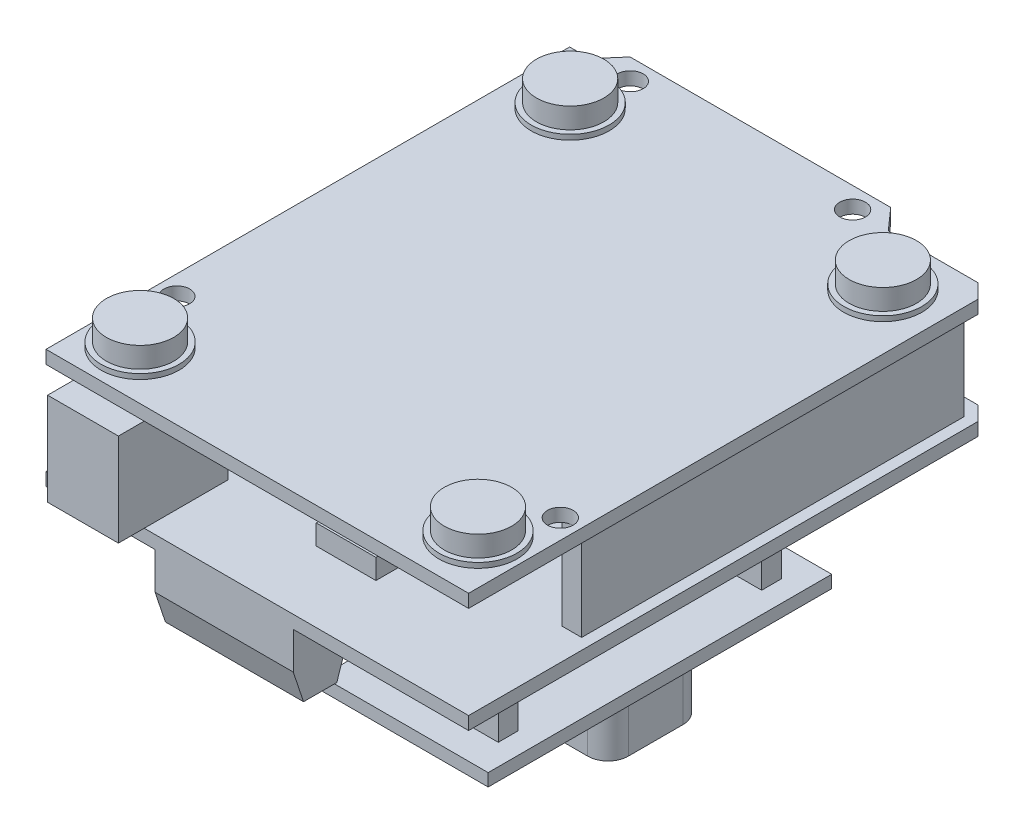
from build123d import *
from OCP.BRepFilletAPI import BRepFilletAPI_MakeChamfer

# Parameters (mm, degrees)
SKETCH1_R                = 1.61925
BOSS_EXTRUDE1_DEPTH      = 1.651
SKETCH2_R                = 4.9149
BOSS_EXTRUDE2_DEPTH      = 0.6477
SKETCH4_R                = 4.2418
BOSS_EXTRUDE3_DEPTH      = 3.2512
SKETCH6_W                = 2.4638
SKETCH6_H                = 48.1457
SKETCH6_H_2              = 38.8493
BOSS_EXTRUDE4_DEPTH      = 11.684
BOSS_EXTRUDE5_DEPTH      = 1.6383
BOSS_EXTRUDE6_DEPTH      = 0.2667
BOSS_EXTRUDE6_DEPTH_BACK = 5.08
SKETCH8_W                = 7.5184
SKETCH8_H                = 2.5273
BOSS_EXTRUDE7_DEPTH      = 3.2512
BOSS_EXTRUDE7_DEPTH_BACK = 10.541
SKETCH9_W                = 8.9154
SKETCH9_H                = 11.684
SKETCH10_W               = 17.399
SKETCH10_H               = 6.7818
SKETCH10_W_2             = 6.7818
SKETCH10_H_2             = 7.0485
BOSS_EXTRUDE8_DEPTH      = 8.5471
CHAMFER1_SIZE            = 3.8862
CHAMFER1_SIZE2           = 1.2954
SKETCH12_W               = 15.367
SKETCH12_H               = 9.0043
BOSS_EXTRUDE9_DEPTH      = 4.6101
SKETCH13_W               = 7.5184
SKETCH13_H               = 5.3467
BOSS_EXTRUDE10_DEPTH     = 2.667
SKETCH14_W               = 2.54
SKETCH14_H               = 5.1816
BOSS_EXTRUDE11_DEPTH     = 16.1544
SKETCH15_W               = 15.113
SKETCH15_H               = 2.4892
BOSS_EXTRUDE12_DEPTH     = 13.208
SKETCH16_W               = 21.0058
SKETCH16_H               = 43.2689
BOSS_EXTRUDE13_DEPTH     = 1.5748
SKETCH17_R               = 3.2258
BOSS_EXTRUDE14_DEPTH     = 5.9944
SKETCH18_R               = 3.2258
BOSS_EXTRUDE15_DEPTH     = 7.9629


with BuildPart() as part:
    # Sketch1 → Boss-Extrude1 (new body)
    with BuildSketch(Plane(origin=(0, 0, 0), x_dir=(1, 0, 0), z_dir=(0, 1, 0))):
        Polygon((0, 65.9511), (2.54, 65.9511), (4.891832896, 68.6689), (37.721332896, 68.6689), (40.130988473, 65.9511), (51.429648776, 65.9511), (53.2257, 64.155048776), (53.2257, 0), (0, 0), align=None)
        with Locations(Location((7.56285, 66.03365, 0), (0, 0, 270))):
            Circle(SKETCH1_R, mode=Mode.SUBTRACT)
        with Locations(Location((35.55365, 66.03365, 0), (0, 0, 270))):
            Circle(SKETCH1_R, mode=Mode.SUBTRACT)
        with Locations(Location((2.4638, 14.01445, 0), (0, 0, 270))):
            Circle(SKETCH1_R, mode=Mode.SUBTRACT)
        with Locations(Location((50.7619, 14.01445, 0), (0, 0, 270))):
            Circle(SKETCH1_R, mode=Mode.SUBTRACT)
    extrude(amount=-BOSS_EXTRUDE1_DEPTH)

    # Sketch2 → Boss-Extrude2 (add)
    with BuildSketch(Plane(origin=(0, 0, 0), x_dir=(1, 0, 0), z_dir=(0, 1, 0))):
        with Locations(Location((46.2153, 59.182, 0), (0, 0, 90))):
            Circle(SKETCH2_R)
        with Locations(Location((6.731, 59.2836, 0), (0, 0, 90))):
            Circle(SKETCH2_R)
        with Locations(Location((5.7531, 6.096, 0), (0, 0, 90))):
            Circle(SKETCH2_R)
        with Locations(Location((47.625, 6.7818, 0), (0, 0, 90))):
            Circle(SKETCH2_R)
    extrude(amount=BOSS_EXTRUDE2_DEPTH)

    # Sketch4 → Boss-Extrude3 (add)
    with BuildSketch(Plane(origin=(0, 0, 0), x_dir=(1, 0, 0), z_dir=(0, 1, 0))):
        with Locations(Location((47.625, 6.7818, 0), (0, 0, 270))):
            Circle(SKETCH4_R)
        with Locations(Location((5.7531, 6.096, 0), (0, 0, 270))):
            Circle(SKETCH4_R)
        with Locations(Location((46.2153, 59.182, 0), (0, 0, 270))):
            Circle(SKETCH4_R)
        with Locations(Location((6.731, 59.2836, 0), (0, 0, 270))):
            Circle(SKETCH4_R)
    extrude(amount=BOSS_EXTRUDE3_DEPTH)

    # Sketch6 → Boss-Extrude4 (add)
    with BuildSketch(Plane.XZ.offset(1.651)):
        with Locations((50.5968, -39.70655)):
            Rectangle(SKETCH6_W, SKETCH6_H)
        with Locations((2.6289, -44.35475)):
            Rectangle(SKETCH6_W, SKETCH6_H_2)
    extrude(amount=BOSS_EXTRUDE4_DEPTH)

    # Sketch7 → Boss-Extrude5 (add)
    with BuildSketch(Plane.XZ.offset(13.335)):
        Polygon((0, 0), (53.2257, 0), (53.2257, -64.155048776), (51.429648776, -65.9511), (40.130988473, -65.9511), (37.721332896, -68.6689), (4.891832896, -68.6689), (2.54, -65.9511), (0, -65.9511), align=None)
    extrude(amount=BOSS_EXTRUDE5_DEPTH)

    # Sketch8 → Boss-Extrude6 (add, two sides: drawn at the far end of the back side and taken through both)
    with BuildSketch(Plane.XY.offset(-BOSS_EXTRUDE6_DEPTH_BACK)):
        with Locations((38.0619, -2.91465)):
            Rectangle(SKETCH8_W, SKETCH8_H)
    extrude(amount=BOSS_EXTRUDE6_DEPTH + BOSS_EXTRUDE6_DEPTH_BACK)

    # Sketch9 → Boss-Extrude7 (add, two sides: drawn at the far end of the back side and taken through both)
    with BuildSketch(Plane.XY.offset(-BOSS_EXTRUDE7_DEPTH_BACK)):
        with Locations((7.9121, -7.493)):
            Rectangle(SKETCH9_W, SKETCH9_H)
    extrude(amount=BOSS_EXTRUDE7_DEPTH + BOSS_EXTRUDE7_DEPTH_BACK)

    # Sketch10 → Boss-Extrude8 (add)
    with BuildSketch(Plane.XZ.offset(14.9733)):
        with Locations((22.4409, -3.3909)):
            Rectangle(SKETCH10_W, SKETCH10_H)
        with Locations((3.3909, -20.35175)):
            Rectangle(SKETCH10_W_2, SKETCH10_H_2)
        with Locations((14.1097, -65.278)):
            Rectangle(SKETCH10_W, SKETCH10_H)
    extrude(amount=BOSS_EXTRUDE8_DEPTH)

    # Chamfer1: one chamfer whose edges measure the first distance from different faces: ONE call of the kernel's chamfer builder (chamfer() names one face for all edges)
    chamfer1_edges_1 = [part.edges().sort_by_distance(p)[0] for p in [
        (22.4409, -23.5204, -6.7818),
    ]]
    chamfer1_side_1 = [part.faces().sort_by_distance(p)[0] for p in [
        (22.4409, -19.24685, -6.7818),
    ]]
    chamfer1_edges_2 = [part.edges().sort_by_distance(p)[0] for p in [
        (22.4409, -23.5204, 0),
    ]]
    chamfer1_side_2 = [part.faces().sort_by_distance(p)[0] for p in [
        (23.982978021, -17.364435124, 0),
    ]]
    chamfer1_edges_3 = [part.edges().sort_by_distance(p)[0] for p in [
        (0, -23.5204, -20.35175),
    ]]
    chamfer1_side_3 = [part.faces().sort_by_distance(p)[0] for p in [
        (0, -14.15415, -65.283770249),
    ]]
    chamfer1_edges_4 = [part.edges().sort_by_distance(p)[0] for p in [
        (6.7818, -23.5204, -20.35175),
    ]]
    chamfer1_side_4 = [part.faces().sort_by_distance(p)[0] for p in [
        (6.7818, -19.24685, -20.35175),
    ]]
    chamfer1_edges_5 = [part.edges().sort_by_distance(p)[0] for p in [
        (14.1097, -23.5204, -68.6689),
    ]]
    chamfer1_side_5 = [part.faces().sort_by_distance(p)[0] for p in [
        (16.021254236, -17.894184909, -68.6689),
    ]]
    chamfer1_edges_6 = [part.edges().sort_by_distance(p)[0] for p in [
        (14.1097, -23.5204, -61.8871),
    ]]
    chamfer1_side_6 = [part.faces().sort_by_distance(p)[0] for p in [
        (14.1097, -19.24685, -61.8871),
    ]]
    chamfer1 = BRepFilletAPI_MakeChamfer(part.part.solid().wrapped)
    for e in chamfer1_edges_1:
        chamfer1.Add(CHAMFER1_SIZE, CHAMFER1_SIZE2, e.wrapped, chamfer1_side_1[0].wrapped)  # the first distance lies on this face
    for e in chamfer1_edges_2:
        chamfer1.Add(CHAMFER1_SIZE, CHAMFER1_SIZE2, e.wrapped, chamfer1_side_2[0].wrapped)  # the first distance lies on this face
    for e in chamfer1_edges_3:
        chamfer1.Add(CHAMFER1_SIZE, CHAMFER1_SIZE2, e.wrapped, chamfer1_side_3[0].wrapped)  # the first distance lies on this face
    for e in chamfer1_edges_4:
        chamfer1.Add(CHAMFER1_SIZE, CHAMFER1_SIZE2, e.wrapped, chamfer1_side_4[0].wrapped)  # the first distance lies on this face
    for e in chamfer1_edges_5:
        chamfer1.Add(CHAMFER1_SIZE, CHAMFER1_SIZE2, e.wrapped, chamfer1_side_5[0].wrapped)  # the first distance lies on this face
    for e in chamfer1_edges_6:
        chamfer1.Add(CHAMFER1_SIZE, CHAMFER1_SIZE2, e.wrapped, chamfer1_side_6[0].wrapped)  # the first distance lies on this face
    add(Compound.cast(chamfer1.Shape()), mode=Mode.REPLACE)

    # Sketch12 → Boss-Extrude9 (add)
    with BuildSketch(Plane.XZ.offset(14.9733)):
        with Locations((38.2778, -61.44895)):
            Rectangle(SKETCH12_W, SKETCH12_H)
    extrude(amount=BOSS_EXTRUDE9_DEPTH)

    # Sketch13 → Boss-Extrude10 (add)
    with BuildSketch(Plane.XZ.offset(19.5834)):
        with Locations((38.2778, -64.52235)):
            Rectangle(SKETCH13_W, SKETCH13_H)
    extrude(amount=BOSS_EXTRUDE10_DEPTH)

    # Sketch14 → Boss-Extrude11 (add)
    with BuildSketch(Plane.XZ.offset(14.9733)):
        with Locations((9.9568, -21.2852)):
            Rectangle(SKETCH14_W, SKETCH14_H)
    extrude(amount=BOSS_EXTRUDE11_DEPTH)

    # Sketch15 → Boss-Extrude12 (add)
    with BuildSketch(Plane.XZ.offset(14.9733)):
        with Locations((35.6108, -15.0368)):
            Rectangle(SKETCH15_W, SKETCH15_H)
        with Locations((35.6108, -48.2092)):
            Rectangle(SKETCH15_W, SKETCH15_H)
    extrude(amount=BOSS_EXTRUDE12_DEPTH)

    # Sketch16 → Boss-Extrude13 (add)
    with BuildSketch(Plane.XZ.offset(28.1813)):
        with Locations((35.3314, -31.48965)):
            Rectangle(SKETCH16_W, SKETCH16_H)
    extrude(amount=BOSS_EXTRUDE13_DEPTH)

    # Sketch17 → Boss-Extrude14 (add)
    with BuildSketch(Plane.XZ.offset(29.7561)):
        with Locations(Location((30.1879, -19.9644, 0), (0, 0, 90))):
            Circle(SKETCH17_R)
        with BuildLine():
            Line((42.744862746, -37.49675), (35.842737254, -37.49675))
            ThreePointArc((35.842737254, -37.49675), (34.035345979, -36.748104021), (33.2867, -34.940712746))
            Line((33.2867, -34.940712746), (33.2867, -28.038587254))
            ThreePointArc((33.2867, -28.038587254), (34.035345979, -26.231195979), (35.842737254, -25.48255))
            Line((35.842737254, -25.48255), (42.744862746, -25.48255))
            ThreePointArc((42.744862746, -25.48255), (44.552254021, -26.231195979), (45.3009, -28.038587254))
            Line((45.3009, -28.038587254), (45.3009, -34.940712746))
            ThreePointArc((45.3009, -34.940712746), (44.552254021, -36.748104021), (42.744862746, -37.49675))
        make_face()
    extrude(amount=BOSS_EXTRUDE14_DEPTH)

    # Sketch18 → Boss-Extrude15 (add)
    with BuildSketch(Plane.XZ.offset(29.7561)):
        with Locations(Location((30.1879, -43.1292, 0), (0, 0, 270))):
            Circle(SKETCH18_R)
    extrude(amount=BOSS_EXTRUDE15_DEPTH)


solid = part.part
